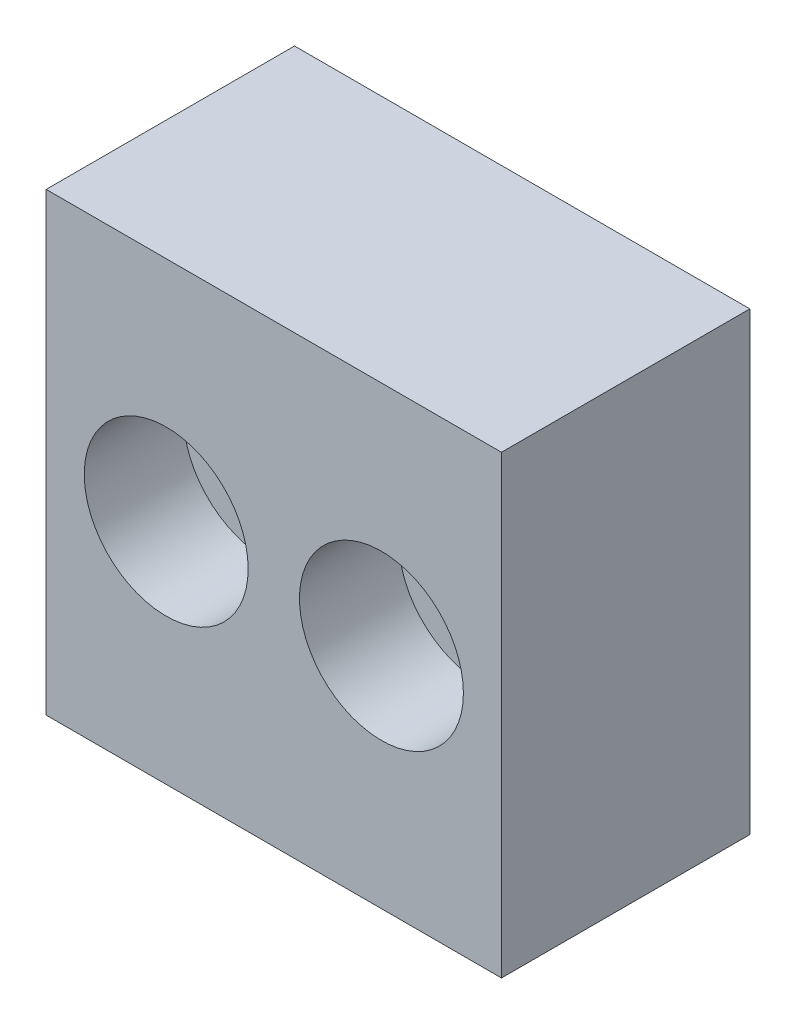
ISO-10303-21;
HEADER;
FILE_DESCRIPTION(('STEP AP214'),'2;1');
FILE_NAME('part.step','',(''),(''),'','','');
FILE_SCHEMA(('AUTOMOTIVE_DESIGN { 1 0 10303 214 1 1 1 1 }'));
ENDSEC;
DATA;
#1=APPLICATION_CONTEXT('core data for automotive mechanical design processes');
#2=APPLICATION_PROTOCOL_DEFINITION('international standard','automotive_design',2000,#1);
#3=PRODUCT_CONTEXT('',#1,'mechanical');
#4=PRODUCT('Part','Part','',(#3));
#5=PRODUCT_RELATED_PRODUCT_CATEGORY('part','',(#4));
#6=PRODUCT_DEFINITION_FORMATION('','',#4);
#7=PRODUCT_DEFINITION_CONTEXT('part definition',#1,'design');
#8=PRODUCT_DEFINITION('design','',#6,#7);
#9=PRODUCT_DEFINITION_SHAPE('','',#8);
#10=(LENGTH_UNIT() NAMED_UNIT(*) SI_UNIT(.MILLI.,.METRE.));
#11=(NAMED_UNIT(*) PLANE_ANGLE_UNIT() SI_UNIT($,.RADIAN.));
#12=(NAMED_UNIT(*) SI_UNIT($,.STERADIAN.) SOLID_ANGLE_UNIT());
#13=UNCERTAINTY_MEASURE_WITH_UNIT(LENGTH_MEASURE(1.E-05),#10,'distance_accuracy_value','');
#14=(GEOMETRIC_REPRESENTATION_CONTEXT(3) GLOBAL_UNCERTAINTY_ASSIGNED_CONTEXT((#13)) GLOBAL_UNIT_ASSIGNED_CONTEXT((#10,
#11,#12)) REPRESENTATION_CONTEXT('',''));
#15=CARTESIAN_POINT('',(0.,0.,0.));
#16=DIRECTION('',(0.,0.,1.));
#17=DIRECTION('',(1.,0.,0.));
#18=AXIS2_PLACEMENT_3D('',#15,#16,#17);
#19=CARTESIAN_POINT('',(-14.5,27.5,30.));
#20=DIRECTION('',(1.,0.,0.));
#21=DIRECTION('',(0.,1.,0.));
#22=AXIS2_PLACEMENT_3D('',#19,#20,#21);
#23=PLANE('',#22);
#24=DIRECTION('',(0.,-1.,0.));
#25=VECTOR('',#24,1.);
#26=CARTESIAN_POINT('',(-14.5,27.5,0.));
#27=LINE('',#26,#25);
#28=CARTESIAN_POINT('',(-14.5,27.5,0.));
#29=VERTEX_POINT('',#28);
#30=CARTESIAN_POINT('',(-14.5,-27.5,0.));
#31=VERTEX_POINT('',#30);
#32=EDGE_CURVE('E94',#29,#31,#27,.T.);
#33=ORIENTED_EDGE('',*,*,#32,.T.);
#34=DIRECTION('',(0.,0.,-1.));
#35=VECTOR('',#34,1.);
#36=CARTESIAN_POINT('',(-14.5,-27.5,30.));
#37=LINE('',#36,#35);
#38=CARTESIAN_POINT('',(-14.5,-27.5,30.));
#39=VERTEX_POINT('',#38);
#40=EDGE_CURVE('E9',#39,#31,#37,.T.);
#41=ORIENTED_EDGE('',*,*,#40,.F.);
#42=DIRECTION('',(0.,-1.,0.));
#43=VECTOR('',#42,1.);
#44=CARTESIAN_POINT('',(-14.5,27.5,30.));
#45=LINE('',#44,#43);
#46=CARTESIAN_POINT('',(-14.5,27.5,30.));
#47=VERTEX_POINT('',#46);
#48=EDGE_CURVE('E57',#47,#39,#45,.T.);
#49=ORIENTED_EDGE('',*,*,#48,.F.);
#50=DIRECTION('',(0.,0.,-1.));
#51=VECTOR('',#50,1.);
#52=CARTESIAN_POINT('',(-14.5,27.5,30.));
#53=LINE('',#52,#51);
#54=EDGE_CURVE('E104',#47,#29,#53,.T.);
#55=ORIENTED_EDGE('',*,*,#54,.T.);
#56=EDGE_LOOP('',(#33,#41,#49,#55));
#57=FACE_BOUND('',#56,.T.);
#58=ADVANCED_FACE('F14',(#57),#23,.F.);
#59=CARTESIAN_POINT('',(-14.5,-27.5,30.));
#60=DIRECTION('',(0.,1.,0.));
#61=DIRECTION('',(0.,0.,1.));
#62=AXIS2_PLACEMENT_3D('',#59,#60,#61);
#63=PLANE('',#62);
#64=DIRECTION('',(1.,0.,0.));
#65=VECTOR('',#64,1.);
#66=CARTESIAN_POINT('',(-14.5,-27.5,0.));
#67=LINE('',#66,#65);
#68=CARTESIAN_POINT('',(40.5,-27.5,0.));
#69=VERTEX_POINT('',#68);
#70=EDGE_CURVE('E62',#31,#69,#67,.T.);
#71=ORIENTED_EDGE('',*,*,#70,.T.);
#72=DIRECTION('',(0.,0.,-1.));
#73=VECTOR('',#72,1.);
#74=CARTESIAN_POINT('',(40.5,-27.5,30.));
#75=LINE('',#74,#73);
#76=CARTESIAN_POINT('',(40.5,-27.5,30.));
#77=VERTEX_POINT('',#76);
#78=EDGE_CURVE('E21',#77,#69,#75,.T.);
#79=ORIENTED_EDGE('',*,*,#78,.F.);
#80=DIRECTION('',(1.,0.,0.));
#81=VECTOR('',#80,1.);
#82=CARTESIAN_POINT('',(-14.5,-27.5,30.));
#83=LINE('',#82,#81);
#84=EDGE_CURVE('E35',#39,#77,#83,.T.);
#85=ORIENTED_EDGE('',*,*,#84,.F.);
#86=ORIENTED_EDGE('',*,*,#40,.T.);
#87=EDGE_LOOP('',(#71,#79,#85,#86));
#88=FACE_BOUND('',#87,.T.);
#89=ADVANCED_FACE('F61',(#88),#63,.F.);
#90=CARTESIAN_POINT('',(40.5,27.5,30.));
#91=DIRECTION('',(-1.,0.,0.));
#92=DIRECTION('',(0.,-1.,0.));
#93=AXIS2_PLACEMENT_3D('',#90,#91,#92);
#94=PLANE('',#93);
#95=DIRECTION('',(0.,0.,-1.));
#96=VECTOR('',#95,1.);
#97=CARTESIAN_POINT('',(40.5,27.5,30.));
#98=LINE('',#97,#96);
#99=CARTESIAN_POINT('',(40.5,27.5,30.));
#100=VERTEX_POINT('',#99);
#101=CARTESIAN_POINT('',(40.5,27.5,0.));
#102=VERTEX_POINT('',#101);
#103=EDGE_CURVE('E66',#100,#102,#98,.T.);
#104=ORIENTED_EDGE('',*,*,#103,.F.);
#105=DIRECTION('',(0.,1.,0.));
#106=VECTOR('',#105,1.);
#107=CARTESIAN_POINT('',(40.5,-27.5,30.));
#108=LINE('',#107,#106);
#109=EDGE_CURVE('E55',#77,#100,#108,.T.);
#110=ORIENTED_EDGE('',*,*,#109,.F.);
#111=ORIENTED_EDGE('',*,*,#78,.T.);
#112=DIRECTION('',(0.,1.,0.));
#113=VECTOR('',#112,1.);
#114=CARTESIAN_POINT('',(40.5,27.5,0.));
#115=LINE('',#114,#113);
#116=EDGE_CURVE('E98',#69,#102,#115,.T.);
#117=ORIENTED_EDGE('',*,*,#116,.T.);
#118=EDGE_LOOP('',(#104,#110,#111,#117));
#119=FACE_BOUND('',#118,.T.);
#120=ADVANCED_FACE('F67',(#119),#94,.F.);
#121=CARTESIAN_POINT('',(-14.5,27.5,30.));
#122=DIRECTION('',(0.,-1.,0.));
#123=DIRECTION('',(0.,0.,-1.));
#124=AXIS2_PLACEMENT_3D('',#121,#122,#123);
#125=PLANE('',#124);
#126=ORIENTED_EDGE('',*,*,#54,.F.);
#127=DIRECTION('',(-1.,0.,0.));
#128=VECTOR('',#127,1.);
#129=CARTESIAN_POINT('',(-14.5,27.5,30.));
#130=LINE('',#129,#128);
#131=EDGE_CURVE('E28',#100,#47,#130,.T.);
#132=ORIENTED_EDGE('',*,*,#131,.F.);
#133=ORIENTED_EDGE('',*,*,#103,.T.);
#134=DIRECTION('',(-1.,0.,0.));
#135=VECTOR('',#134,1.);
#136=CARTESIAN_POINT('',(-14.5,27.5,0.));
#137=LINE('',#136,#135);
#138=EDGE_CURVE('E100',#102,#29,#137,.T.);
#139=ORIENTED_EDGE('',*,*,#138,.T.);
#140=EDGE_LOOP('',(#126,#132,#133,#139));
#141=FACE_BOUND('',#140,.T.);
#142=ADVANCED_FACE('F108',(#141),#125,.F.);
#143=CARTESIAN_POINT('',(-14.5,-27.5,30.));
#144=DIRECTION('',(0.,0.,1.));
#145=DIRECTION('',(1.,0.,0.));
#146=AXIS2_PLACEMENT_3D('',#143,#144,#145);
#147=PLANE('',#146);
#148=ORIENTED_EDGE('',*,*,#84,.T.);
#149=ORIENTED_EDGE('',*,*,#109,.T.);
#150=ORIENTED_EDGE('',*,*,#131,.T.);
#151=ORIENTED_EDGE('',*,*,#48,.T.);
#152=EDGE_LOOP('',(#148,#149,#150,#151));
#153=FACE_BOUND('',#152,.T.);
#154=CARTESIAN_POINT('',(26.,0.,30.));
#155=DIRECTION('',(0.,0.,1.));
#156=DIRECTION('',(1.,0.,0.));
#157=AXIS2_PLACEMENT_3D('',#154,#155,#156);
#158=CIRCLE('',#157,9.9);
#159=CARTESIAN_POINT('',(35.9,0.,30.));
#160=VERTEX_POINT('',#159);
#161=EDGE_CURVE('E79',#160,#160,#158,.T.);
#162=ORIENTED_EDGE('',*,*,#161,.F.);
#163=EDGE_LOOP('',(#162));
#164=FACE_BOUND('',#163,.T.);
#165=CARTESIAN_POINT('',(0.,0.,30.));
#166=DIRECTION('',(0.,0.,1.));
#167=DIRECTION('',(1.,0.,0.));
#168=AXIS2_PLACEMENT_3D('',#165,#166,#167);
#169=CIRCLE('',#168,9.9);
#170=CARTESIAN_POINT('',(9.9,0.,30.));
#171=VERTEX_POINT('',#170);
#172=EDGE_CURVE('E91',#171,#171,#169,.T.);
#173=ORIENTED_EDGE('',*,*,#172,.F.);
#174=EDGE_LOOP('',(#173));
#175=FACE_BOUND('',#174,.T.);
#176=ADVANCED_FACE('F52',(#153,#164,#175),#147,.T.);
#177=CARTESIAN_POINT('',(-14.5,-27.5,0.));
#178=DIRECTION('',(0.,0.,1.));
#179=DIRECTION('',(1.,0.,0.));
#180=AXIS2_PLACEMENT_3D('',#177,#178,#179);
#181=PLANE('',#180);
#182=CARTESIAN_POINT('',(26.,0.,0.));
#183=DIRECTION('',(0.,0.,1.));
#184=DIRECTION('',(1.,0.,0.));
#185=AXIS2_PLACEMENT_3D('',#182,#183,#184);
#186=CIRCLE('',#185,7.);
#187=CARTESIAN_POINT('',(33.,0.,0.));
#188=VERTEX_POINT('',#187);
#189=EDGE_CURVE('E68',#188,#188,#186,.T.);
#190=ORIENTED_EDGE('',*,*,#189,.T.);
#191=EDGE_LOOP('',(#190));
#192=FACE_BOUND('',#191,.T.);
#193=CARTESIAN_POINT('',(0.,0.,0.));
#194=DIRECTION('',(0.,0.,1.));
#195=DIRECTION('',(1.,0.,0.));
#196=AXIS2_PLACEMENT_3D('',#193,#194,#195);
#197=CIRCLE('',#196,7.);
#198=CARTESIAN_POINT('',(7.,0.,0.));
#199=VERTEX_POINT('',#198);
#200=EDGE_CURVE('E82',#199,#199,#197,.T.);
#201=ORIENTED_EDGE('',*,*,#200,.T.);
#202=EDGE_LOOP('',(#201));
#203=FACE_BOUND('',#202,.T.);
#204=ORIENTED_EDGE('',*,*,#32,.F.);
#205=ORIENTED_EDGE('',*,*,#138,.F.);
#206=ORIENTED_EDGE('',*,*,#116,.F.);
#207=ORIENTED_EDGE('',*,*,#70,.F.);
#208=EDGE_LOOP('',(#204,#205,#206,#207));
#209=FACE_BOUND('',#208,.T.);
#210=ADVANCED_FACE('F112',(#192,#203,#209),#181,.F.);
#211=CARTESIAN_POINT('',(0.,0.,30.));
#212=DIRECTION('',(0.,0.,1.));
#213=DIRECTION('',(1.,0.,0.));
#214=AXIS2_PLACEMENT_3D('',#211,#212,#213);
#215=CYLINDRICAL_SURFACE('',#214,9.9);
#216=CARTESIAN_POINT('',(0.,0.,18.));
#217=DIRECTION('',(0.,0.,1.));
#218=DIRECTION('',(1.,0.,0.));
#219=AXIS2_PLACEMENT_3D('',#216,#217,#218);
#220=CIRCLE('',#219,9.9);
#221=CARTESIAN_POINT('',(9.9,0.,18.));
#222=VERTEX_POINT('',#221);
#223=EDGE_CURVE('E88',#222,#222,#220,.T.);
#224=ORIENTED_EDGE('',*,*,#223,.F.);
#225=EDGE_LOOP('',(#224));
#226=FACE_BOUND('',#225,.T.);
#227=ORIENTED_EDGE('',*,*,#172,.T.);
#228=EDGE_LOOP('',(#227));
#229=FACE_BOUND('',#228,.T.);
#230=ADVANCED_FACE('F132',(#226,#229),#215,.F.);
#231=CARTESIAN_POINT('',(7.,0.,18.));
#232=DIRECTION('',(0.,0.,-1.));
#233=DIRECTION('',(-1.,0.,0.));
#234=AXIS2_PLACEMENT_3D('',#231,#232,#233);
#235=PLANE('',#234);
#236=CARTESIAN_POINT('',(0.,0.,18.));
#237=DIRECTION('',(0.,0.,1.));
#238=DIRECTION('',(1.,0.,0.));
#239=AXIS2_PLACEMENT_3D('',#236,#237,#238);
#240=CIRCLE('',#239,7.);
#241=CARTESIAN_POINT('',(7.,0.,18.));
#242=VERTEX_POINT('',#241);
#243=EDGE_CURVE('E85',#242,#242,#240,.T.);
#244=ORIENTED_EDGE('',*,*,#243,.F.);
#245=EDGE_LOOP('',(#244));
#246=FACE_BOUND('',#245,.T.);
#247=ORIENTED_EDGE('',*,*,#223,.T.);
#248=EDGE_LOOP('',(#247));
#249=FACE_BOUND('',#248,.T.);
#250=ADVANCED_FACE('F136',(#246,#249),#235,.F.);
#251=CARTESIAN_POINT('',(0.,0.,30.));
#252=DIRECTION('',(0.,0.,1.));
#253=DIRECTION('',(1.,0.,0.));
#254=AXIS2_PLACEMENT_3D('',#251,#252,#253);
#255=CYLINDRICAL_SURFACE('',#254,7.);
#256=ORIENTED_EDGE('',*,*,#200,.F.);
#257=EDGE_LOOP('',(#256));
#258=FACE_BOUND('',#257,.T.);
#259=ORIENTED_EDGE('',*,*,#243,.T.);
#260=EDGE_LOOP('',(#259));
#261=FACE_BOUND('',#260,.T.);
#262=ADVANCED_FACE('F140',(#258,#261),#255,.F.);
#263=CARTESIAN_POINT('',(26.,0.,30.));
#264=DIRECTION('',(0.,0.,1.));
#265=DIRECTION('',(1.,0.,0.));
#266=AXIS2_PLACEMENT_3D('',#263,#264,#265);
#267=CYLINDRICAL_SURFACE('',#266,9.9);
#268=CARTESIAN_POINT('',(26.,0.,18.));
#269=DIRECTION('',(0.,0.,1.));
#270=DIRECTION('',(1.,0.,0.));
#271=AXIS2_PLACEMENT_3D('',#268,#269,#270);
#272=CIRCLE('',#271,9.9);
#273=CARTESIAN_POINT('',(35.9,0.,18.));
#274=VERTEX_POINT('',#273);
#275=EDGE_CURVE('E76',#274,#274,#272,.T.);
#276=ORIENTED_EDGE('',*,*,#275,.F.);
#277=EDGE_LOOP('',(#276));
#278=FACE_BOUND('',#277,.T.);
#279=ORIENTED_EDGE('',*,*,#161,.T.);
#280=EDGE_LOOP('',(#279));
#281=FACE_BOUND('',#280,.T.);
#282=ADVANCED_FACE('F144',(#278,#281),#267,.F.);
#283=CARTESIAN_POINT('',(33.,0.,18.));
#284=DIRECTION('',(0.,0.,-1.));
#285=DIRECTION('',(-1.,0.,0.));
#286=AXIS2_PLACEMENT_3D('',#283,#284,#285);
#287=PLANE('',#286);
#288=CARTESIAN_POINT('',(26.,0.,18.));
#289=DIRECTION('',(0.,0.,1.));
#290=DIRECTION('',(1.,0.,0.));
#291=AXIS2_PLACEMENT_3D('',#288,#289,#290);
#292=CIRCLE('',#291,7.);
#293=CARTESIAN_POINT('',(33.,0.,18.));
#294=VERTEX_POINT('',#293);
#295=EDGE_CURVE('E71',#294,#294,#292,.T.);
#296=ORIENTED_EDGE('',*,*,#295,.F.);
#297=EDGE_LOOP('',(#296));
#298=FACE_BOUND('',#297,.T.);
#299=ORIENTED_EDGE('',*,*,#275,.T.);
#300=EDGE_LOOP('',(#299));
#301=FACE_BOUND('',#300,.T.);
#302=ADVANCED_FACE('F148',(#298,#301),#287,.F.);
#303=CARTESIAN_POINT('',(26.,0.,30.));
#304=DIRECTION('',(0.,0.,1.));
#305=DIRECTION('',(1.,0.,0.));
#306=AXIS2_PLACEMENT_3D('',#303,#304,#305);
#307=CYLINDRICAL_SURFACE('',#306,7.);
#308=ORIENTED_EDGE('',*,*,#189,.F.);
#309=EDGE_LOOP('',(#308));
#310=FACE_BOUND('',#309,.T.);
#311=ORIENTED_EDGE('',*,*,#295,.T.);
#312=EDGE_LOOP('',(#311));
#313=FACE_BOUND('',#312,.T.);
#314=ADVANCED_FACE('F152',(#310,#313),#307,.F.);
#315=CLOSED_SHELL('',(#58,#89,#120,#142,#176,#210,#230,#250,#262,#282,#302,#314));
#316=MANIFOLD_SOLID_BREP('B1',#315);
#317=ADVANCED_BREP_SHAPE_REPRESENTATION('',(#18,#316),#14);
#318=SHAPE_DEFINITION_REPRESENTATION(#9,#317);
ENDSEC;
END-ISO-10303-21;
